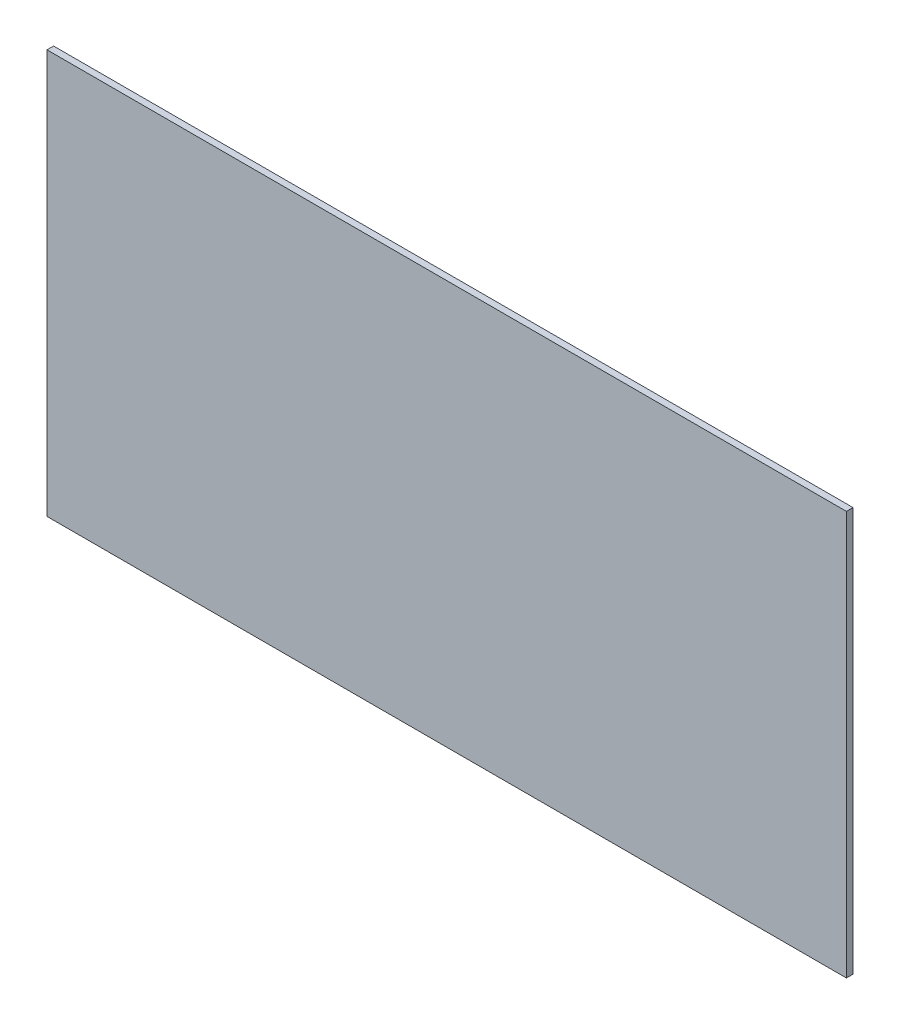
ISO-10303-21;
HEADER;
FILE_DESCRIPTION(('STEP AP214'),'2;1');
FILE_NAME('part.step','',(''),(''),'','','');
FILE_SCHEMA(('AUTOMOTIVE_DESIGN { 1 0 10303 214 1 1 1 1 }'));
ENDSEC;
DATA;
#1=APPLICATION_CONTEXT('core data for automotive mechanical design processes');
#2=APPLICATION_PROTOCOL_DEFINITION('international standard','automotive_design',2000,#1);
#3=PRODUCT_CONTEXT('',#1,'mechanical');
#4=PRODUCT('Part','Part','',(#3));
#5=PRODUCT_RELATED_PRODUCT_CATEGORY('part','',(#4));
#6=PRODUCT_DEFINITION_FORMATION('','',#4);
#7=PRODUCT_DEFINITION_CONTEXT('part definition',#1,'design');
#8=PRODUCT_DEFINITION('design','',#6,#7);
#9=PRODUCT_DEFINITION_SHAPE('','',#8);
#10=(LENGTH_UNIT() NAMED_UNIT(*) SI_UNIT(.MILLI.,.METRE.));
#11=(NAMED_UNIT(*) PLANE_ANGLE_UNIT() SI_UNIT($,.RADIAN.));
#12=(NAMED_UNIT(*) SI_UNIT($,.STERADIAN.) SOLID_ANGLE_UNIT());
#13=UNCERTAINTY_MEASURE_WITH_UNIT(LENGTH_MEASURE(1.E-05),#10,'distance_accuracy_value','');
#14=(GEOMETRIC_REPRESENTATION_CONTEXT(3) GLOBAL_UNCERTAINTY_ASSIGNED_CONTEXT((#13)) GLOBAL_UNIT_ASSIGNED_CONTEXT((#10,
#11,#12)) REPRESENTATION_CONTEXT('',''));
#15=CARTESIAN_POINT('',(0.,0.,0.));
#16=DIRECTION('',(0.,0.,1.));
#17=DIRECTION('',(1.,0.,0.));
#18=AXIS2_PLACEMENT_3D('',#15,#16,#17);
#19=CARTESIAN_POINT('',(0.,0.,3.));
#20=DIRECTION('',(1.,0.,0.));
#21=DIRECTION('',(0.,0.,-1.));
#22=AXIS2_PLACEMENT_3D('',#19,#20,#21);
#23=PLANE('',#22);
#24=DIRECTION('',(0.,-1.,0.));
#25=VECTOR('',#24,1.);
#26=CARTESIAN_POINT('',(0.,0.,0.));
#27=LINE('',#26,#25);
#28=CARTESIAN_POINT('',(0.,184.,0.));
#29=VERTEX_POINT('',#28);
#30=CARTESIAN_POINT('',(0.,0.,0.));
#31=VERTEX_POINT('',#30);
#32=EDGE_CURVE('E70',#29,#31,#27,.T.);
#33=ORIENTED_EDGE('',*,*,#32,.T.);
#34=DIRECTION('',(0.,0.,-1.));
#35=VECTOR('',#34,1.);
#36=CARTESIAN_POINT('',(0.,0.,3.));
#37=LINE('',#36,#35);
#38=CARTESIAN_POINT('',(0.,0.,3.));
#39=VERTEX_POINT('',#38);
#40=EDGE_CURVE('E11',#39,#31,#37,.T.);
#41=ORIENTED_EDGE('',*,*,#40,.F.);
#42=DIRECTION('',(0.,-1.,0.));
#43=VECTOR('',#42,1.);
#44=CARTESIAN_POINT('',(0.,0.,3.));
#45=LINE('',#44,#43);
#46=CARTESIAN_POINT('',(0.,184.,3.));
#47=VERTEX_POINT('',#46);
#48=EDGE_CURVE('E88',#47,#39,#45,.T.);
#49=ORIENTED_EDGE('',*,*,#48,.F.);
#50=DIRECTION('',(0.,0.,-1.));
#51=VECTOR('',#50,1.);
#52=CARTESIAN_POINT('',(0.,184.,3.));
#53=LINE('',#52,#51);
#54=EDGE_CURVE('E82',#47,#29,#53,.T.);
#55=ORIENTED_EDGE('',*,*,#54,.T.);
#56=EDGE_LOOP('',(#33,#41,#49,#55));
#57=FACE_BOUND('',#56,.T.);
#58=ADVANCED_FACE('F26',(#57),#23,.F.);
#59=CARTESIAN_POINT('',(0.,0.,3.));
#60=DIRECTION('',(0.,1.,0.));
#61=DIRECTION('',(0.,0.,1.));
#62=AXIS2_PLACEMENT_3D('',#59,#60,#61);
#63=PLANE('',#62);
#64=DIRECTION('',(1.,0.,0.));
#65=VECTOR('',#64,1.);
#66=CARTESIAN_POINT('',(0.,0.,0.));
#67=LINE('',#66,#65);
#68=CARTESIAN_POINT('',(364.,0.,0.));
#69=VERTEX_POINT('',#68);
#70=EDGE_CURVE('E66',#31,#69,#67,.T.);
#71=ORIENTED_EDGE('',*,*,#70,.T.);
#72=DIRECTION('',(0.,0.,-1.));
#73=VECTOR('',#72,1.);
#74=CARTESIAN_POINT('',(364.,0.,3.));
#75=LINE('',#74,#73);
#76=CARTESIAN_POINT('',(364.,0.,3.));
#77=VERTEX_POINT('',#76);
#78=EDGE_CURVE('E33',#77,#69,#75,.T.);
#79=ORIENTED_EDGE('',*,*,#78,.F.);
#80=DIRECTION('',(1.,0.,0.));
#81=VECTOR('',#80,1.);
#82=CARTESIAN_POINT('',(0.,0.,3.));
#83=LINE('',#82,#81);
#84=EDGE_CURVE('E78',#39,#77,#83,.T.);
#85=ORIENTED_EDGE('',*,*,#84,.F.);
#86=ORIENTED_EDGE('',*,*,#40,.T.);
#87=EDGE_LOOP('',(#71,#79,#85,#86));
#88=FACE_BOUND('',#87,.T.);
#89=ADVANCED_FACE('F77',(#88),#63,.F.);
#90=CARTESIAN_POINT('',(364.,0.,3.));
#91=DIRECTION('',(-1.,0.,0.));
#92=DIRECTION('',(0.,0.,1.));
#93=AXIS2_PLACEMENT_3D('',#90,#91,#92);
#94=PLANE('',#93);
#95=DIRECTION('',(0.,1.,0.));
#96=VECTOR('',#95,1.);
#97=CARTESIAN_POINT('',(364.,0.,0.));
#98=LINE('',#97,#96);
#99=CARTESIAN_POINT('',(364.,184.,0.));
#100=VERTEX_POINT('',#99);
#101=EDGE_CURVE('E71',#69,#100,#98,.T.);
#102=ORIENTED_EDGE('',*,*,#101,.T.);
#103=DIRECTION('',(0.,0.,-1.));
#104=VECTOR('',#103,1.);
#105=CARTESIAN_POINT('',(364.,184.,3.));
#106=LINE('',#105,#104);
#107=CARTESIAN_POINT('',(364.,184.,3.));
#108=VERTEX_POINT('',#107);
#109=EDGE_CURVE('E94',#108,#100,#106,.T.);
#110=ORIENTED_EDGE('',*,*,#109,.F.);
#111=DIRECTION('',(0.,1.,0.));
#112=VECTOR('',#111,1.);
#113=CARTESIAN_POINT('',(364.,0.,3.));
#114=LINE('',#113,#112);
#115=EDGE_CURVE('E45',#77,#108,#114,.T.);
#116=ORIENTED_EDGE('',*,*,#115,.F.);
#117=ORIENTED_EDGE('',*,*,#78,.T.);
#118=EDGE_LOOP('',(#102,#110,#116,#117));
#119=FACE_BOUND('',#118,.T.);
#120=ADVANCED_FACE('F97',(#119),#94,.F.);
#121=CARTESIAN_POINT('',(0.,184.,3.));
#122=DIRECTION('',(0.,-1.,0.));
#123=DIRECTION('',(0.,0.,-1.));
#124=AXIS2_PLACEMENT_3D('',#121,#122,#123);
#125=PLANE('',#124);
#126=DIRECTION('',(-1.,0.,0.));
#127=VECTOR('',#126,1.);
#128=CARTESIAN_POINT('',(0.,184.,0.));
#129=LINE('',#128,#127);
#130=EDGE_CURVE('E86',#100,#29,#129,.T.);
#131=ORIENTED_EDGE('',*,*,#130,.T.);
#132=ORIENTED_EDGE('',*,*,#54,.F.);
#133=DIRECTION('',(-1.,0.,0.));
#134=VECTOR('',#133,1.);
#135=CARTESIAN_POINT('',(0.,184.,3.));
#136=LINE('',#135,#134);
#137=EDGE_CURVE('E40',#108,#47,#136,.T.);
#138=ORIENTED_EDGE('',*,*,#137,.F.);
#139=ORIENTED_EDGE('',*,*,#109,.T.);
#140=EDGE_LOOP('',(#131,#132,#138,#139));
#141=FACE_BOUND('',#140,.T.);
#142=ADVANCED_FACE('F99',(#141),#125,.F.);
#143=CARTESIAN_POINT('',(0.,184.,3.));
#144=DIRECTION('',(0.,0.,-1.));
#145=DIRECTION('',(-1.,0.,0.));
#146=AXIS2_PLACEMENT_3D('',#143,#144,#145);
#147=PLANE('',#146);
#148=ORIENTED_EDGE('',*,*,#48,.T.);
#149=ORIENTED_EDGE('',*,*,#84,.T.);
#150=ORIENTED_EDGE('',*,*,#115,.T.);
#151=ORIENTED_EDGE('',*,*,#137,.T.);
#152=EDGE_LOOP('',(#148,#149,#150,#151));
#153=FACE_BOUND('',#152,.T.);
#154=ADVANCED_FACE('F100',(#153),#147,.F.);
#155=CARTESIAN_POINT('',(0.,184.,0.));
#156=DIRECTION('',(0.,0.,-1.));
#157=DIRECTION('',(-1.,0.,0.));
#158=AXIS2_PLACEMENT_3D('',#155,#156,#157);
#159=PLANE('',#158);
#160=ORIENTED_EDGE('',*,*,#32,.F.);
#161=ORIENTED_EDGE('',*,*,#130,.F.);
#162=ORIENTED_EDGE('',*,*,#101,.F.);
#163=ORIENTED_EDGE('',*,*,#70,.F.);
#164=EDGE_LOOP('',(#160,#161,#162,#163));
#165=FACE_BOUND('',#164,.T.);
#166=ADVANCED_FACE('F67',(#165),#159,.T.);
#167=CLOSED_SHELL('',(#58,#89,#120,#142,#154,#166));
#168=MANIFOLD_SOLID_BREP('B2',#167);
#169=ADVANCED_BREP_SHAPE_REPRESENTATION('',(#18,#168),#14);
#170=SHAPE_DEFINITION_REPRESENTATION(#9,#169);
ENDSEC;
END-ISO-10303-21;
